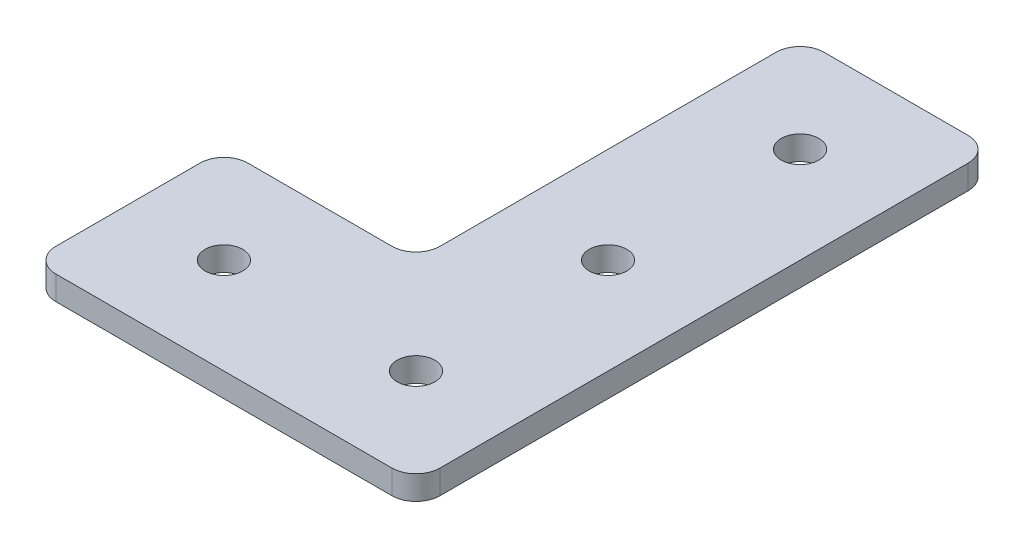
from build123d import *

# Parameters (mm, degrees)
SKETCH1_R           = 2.4892
BOSS_EXTRUDE1_DEPTH = 3.175
FILLET1_R           = 3.175


with BuildPart() as part:
    # Sketch1 → Boss-Extrude1 (new body)
    with BuildSketch(Plane(origin=(0, 0, 0), x_dir=(1, 0, 0), z_dir=(0, 1, 0))):
        Polygon((0, 0), (0, 50.8), (25.4, 50.8), (25.4, -25.4), (-25.4, -25.4), (-25.4, 0), align=None)
        with Locations(Location((12.7, -12.7, 0), (0, 0, 270))):
            Circle(SKETCH1_R, mode=Mode.SUBTRACT)
        with Locations(Location((-12.7, -12.7, 0), (0, 0, 270))):
            Circle(SKETCH1_R, mode=Mode.SUBTRACT)
        with Locations(Location((12.7, 12.7, 0), (0, 0, 270))):
            Circle(SKETCH1_R, mode=Mode.SUBTRACT)
        with Locations(Location((12.7, 38.1, 0), (0, 0, 270))):
            Circle(SKETCH1_R, mode=Mode.SUBTRACT)
    extrude(amount=BOSS_EXTRUDE1_DEPTH)

    # Fillet1
    fillet1_edges = [part.edges().sort_by_distance(p)[0] for p in [
        (0, 1.5875, 0),
        (0, 1.5875, -50.8),
        (25.4, 1.5875, -50.8),
        (25.4, 1.5875, 25.4),
        (-25.4, 1.5875, 25.4),
        (-25.4, 1.5875, 0),
    ]]
    fillet(fillet1_edges, radius=FILLET1_R)


solid = part.part
